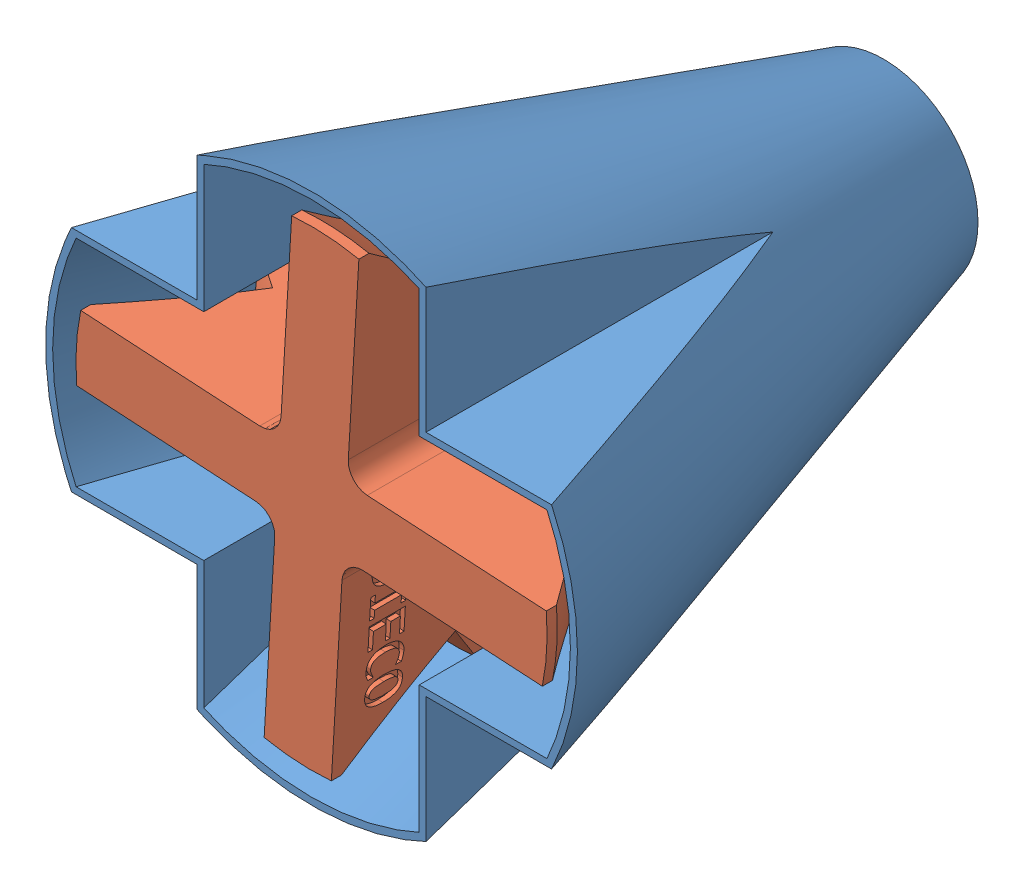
SolidWorks assembly Ensamblaje1.sldasm, configuration Predeterminado (file format 13000). Lengths in mm.
Overall size (79 79 85).
2 component instances, 2 part files, 2 mates.
Components (placement in the parent):
- ContramoldeSlidoArbol4Lados8-1: ContramoldeSlidoArbol4Lados8.SLDPRT [Predeterminado] at (1.469 1.1426 85) size (79 79 85)
- Arbol4Lados8 - final-1: Arbol4Lados8 - final.SLDPRT [Predeterminado] at (1.469 1.1426 83.5) x (-0.059031 -0.998256 0) z (0 0 1) size (70 70 81.5)
Mates (geometry in assembly coordinates):
- Distancia1: distance aligned: plane of Arbol4Lados8 - final-1 through (1.469 1.1426 85) normal (0 0 1); plane of ContramoldeSlidoArbol4Lados8-1 through (1.469 1.1426 85) normal (0 0 1)
- Concéntrica1: concentric anti-aligned: circle of ContramoldeSlidoArbol4Lados8-1; circle of Arbol4Lados8 - final-1
